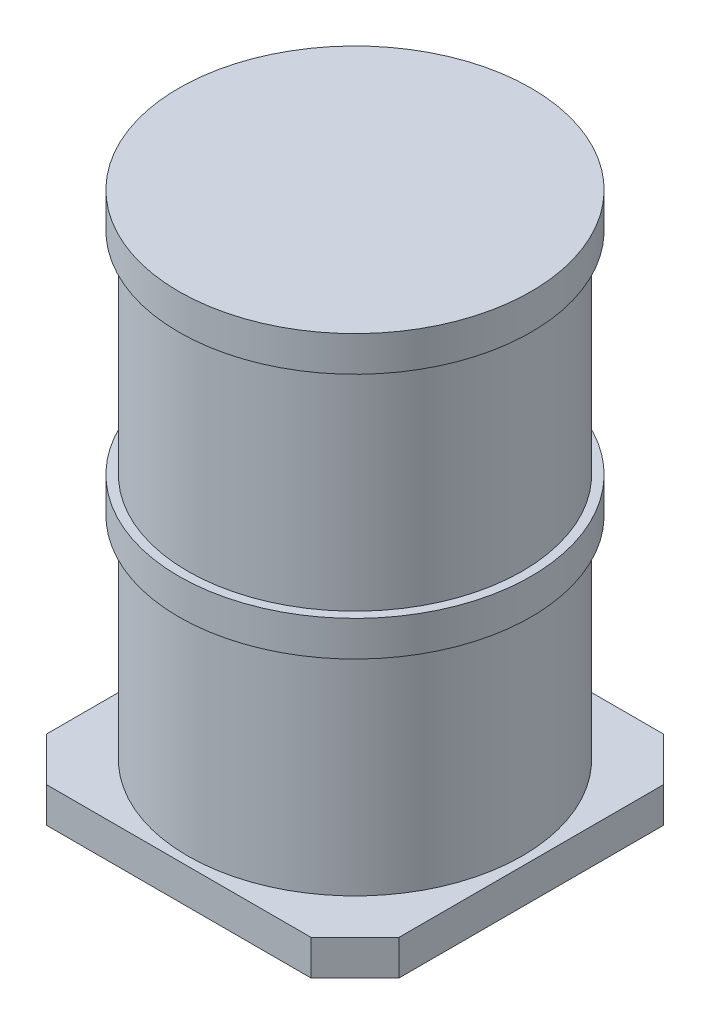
from build123d import *

# Parameters (mm, degrees)
SKETCH1_R           = 2.413
BOSS_EXTRUDE1_DEPTH = 3.048
SKETCH2_R           = 2.54
BOSS_EXTRUDE2_DEPTH = 0.508
SKETCH3_R           = 1.016
CUT_EXTRUDE1_DEPTH  = 1.27
SKETCH4_W           = 5.08
SKETCH4_H           = 5.08
BOSS_EXTRUDE3_DEPTH = 0.508
CUT_EXTRUDE2_START  = -1.27
SKETCH5_R           = 1.016
CUT_EXTRUDE2_DEPTH  = 1.27
CHAMFER1_SIZE       = 0.635
SKETCH8_R           = 2.413
BOSS_EXTRUDE4_DEPTH = 3.048
SKETCH9_R           = 2.54
BOSS_EXTRUDE5_DEPTH = 0.508


with BuildPart() as part:
    # Sketch1 → Boss-Extrude1 (new body)
    with BuildSketch(Plane(origin=(0, 0, 0), x_dir=(1, 0, 0), z_dir=(0, 1, 0))):
        with Locations(Location((0, 0, 0), (0, 0, 90))):
            Circle(SKETCH1_R)
    extrude(amount=BOSS_EXTRUDE1_DEPTH)

    # Sketch2 → Boss-Extrude2 (add)
    with BuildSketch(Plane(origin=(0, 3.048, 0), x_dir=(1, 0, 0), z_dir=(0, 1, 0))):
        with Locations(Location((0, 0, 0), (0, 0, 270))):
            Circle(SKETCH2_R)
    extrude(amount=BOSS_EXTRUDE2_DEPTH)

    # Sketch3 → Cut-Extrude1 (cut)
    with BuildSketch(Plane(origin=(0, 3.556, 0), x_dir=(1, 0, 0), z_dir=(0, 1, 0))):
        with Locations(Location((0, 0, 0), (0, 0, 270))):
            Circle(SKETCH3_R)
    extrude(amount=-CUT_EXTRUDE1_DEPTH, mode=Mode.SUBTRACT)

    # Sketch4 → Boss-Extrude3 (add)
    with BuildSketch(Plane.XZ):
        Rectangle(SKETCH4_W, SKETCH4_H)
    extrude(amount=BOSS_EXTRUDE3_DEPTH)

    # Sketch5 → Cut-Extrude2 (cut)
    with BuildSketch(Plane.XZ.offset(0.508).offset(CUT_EXTRUDE2_START)):
        with Locations(Location((0, 0, 0), (0, 0, 90))):
            Circle(SKETCH5_R)
    extrude(amount=CUT_EXTRUDE2_DEPTH, mode=Mode.SUBTRACT)

    # Chamfer1
    chamfer1_edges = [part.edges().sort_by_distance(p)[0] for p in [
        (2.54, -0.254, -2.54),
        (2.54, -0.254, 2.54),
        (-2.54, -0.254, 2.54),
        (-2.54, -0.254, -2.54),
    ]]
    chamfer(chamfer1_edges, length=CHAMFER1_SIZE)

    # Sketch8 → Boss-Extrude4 (add)
    with BuildSketch(Plane(origin=(0, 3.556, 0), x_dir=(1, 0, 0), z_dir=(0, 1, 0))):
        with Locations(Location((0, 0, 0), (0, 0, 90))):
            Circle(SKETCH8_R)
    extrude(amount=BOSS_EXTRUDE4_DEPTH)

    # Sketch9 → Boss-Extrude5 (add)
    with BuildSketch(Plane(origin=(0, 6.604, 0), x_dir=(1, 0, 0), z_dir=(0, 1, 0))):
        with Locations(Location((0, 0, 0), (0, 0, 270))):
            Circle(SKETCH9_R)
    extrude(amount=BOSS_EXTRUDE5_DEPTH)


solid = part.part
